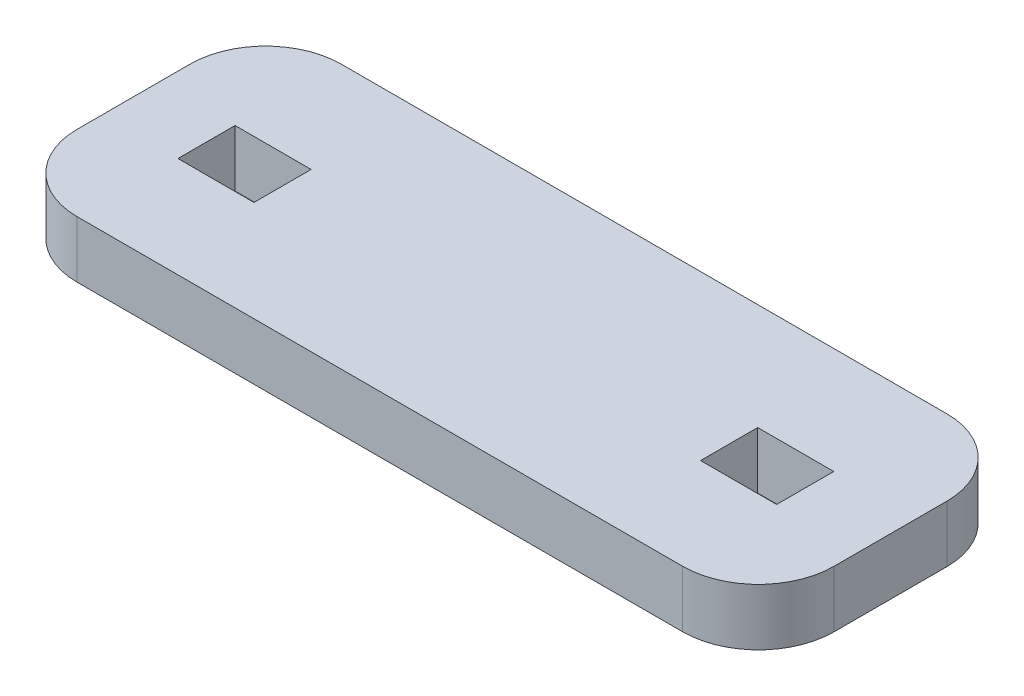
ISO-10303-21;
HEADER;
FILE_DESCRIPTION(('STEP AP214'),'2;1');
FILE_NAME('part.step','',(''),(''),'','','');
FILE_SCHEMA(('AUTOMOTIVE_DESIGN { 1 0 10303 214 1 1 1 1 }'));
ENDSEC;
DATA;
#1=APPLICATION_CONTEXT('core data for automotive mechanical design processes');
#2=APPLICATION_PROTOCOL_DEFINITION('international standard','automotive_design',2000,#1);
#3=PRODUCT_CONTEXT('',#1,'mechanical');
#4=PRODUCT('Part','Part','',(#3));
#5=PRODUCT_RELATED_PRODUCT_CATEGORY('part','',(#4));
#6=PRODUCT_DEFINITION_FORMATION('','',#4);
#7=PRODUCT_DEFINITION_CONTEXT('part definition',#1,'design');
#8=PRODUCT_DEFINITION('design','',#6,#7);
#9=PRODUCT_DEFINITION_SHAPE('','',#8);
#10=(LENGTH_UNIT() NAMED_UNIT(*) SI_UNIT(.MILLI.,.METRE.));
#11=(NAMED_UNIT(*) PLANE_ANGLE_UNIT() SI_UNIT($,.RADIAN.));
#12=(NAMED_UNIT(*) SI_UNIT($,.STERADIAN.) SOLID_ANGLE_UNIT());
#13=UNCERTAINTY_MEASURE_WITH_UNIT(LENGTH_MEASURE(1.E-05),#10,'distance_accuracy_value','');
#14=(GEOMETRIC_REPRESENTATION_CONTEXT(3) GLOBAL_UNCERTAINTY_ASSIGNED_CONTEXT((#13)) GLOBAL_UNIT_ASSIGNED_CONTEXT((#10,
#11,#12)) REPRESENTATION_CONTEXT('',''));
#15=CARTESIAN_POINT('',(0.,0.,0.));
#16=DIRECTION('',(0.,0.,1.));
#17=DIRECTION('',(1.,0.,0.));
#18=AXIS2_PLACEMENT_3D('',#15,#16,#17);
#19=CARTESIAN_POINT('',(232.831111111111,7.5,-32.7377777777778));
#20=DIRECTION('',(0.,-1.,0.));
#21=DIRECTION('',(0.,0.,-1.));
#22=AXIS2_PLACEMENT_3D('',#19,#20,#21);
#23=PLANE('',#22);
#24=DIRECTION('',(0.,0.,1.));
#25=VECTOR('',#24,1.);
#26=CARTESIAN_POINT('',(72.8311111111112,7.5,-24.6641777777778));
#27=LINE('',#26,#25);
#28=CARTESIAN_POINT('',(72.8311111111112,7.5,-24.6641777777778));
#29=VERTEX_POINT('',#28);
#30=CARTESIAN_POINT('',(72.8311111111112,7.5,-9.56417777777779));
#31=VERTEX_POINT('',#30);
#32=EDGE_CURVE('E182',#29,#31,#27,.T.);
#33=ORIENTED_EDGE('',*,*,#32,.F.);
#34=DIRECTION('',(-1.,0.,0.));
#35=VECTOR('',#34,1.);
#36=CARTESIAN_POINT('',(72.8311111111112,7.5,-24.6641777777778));
#37=LINE('',#36,#35);
#38=CARTESIAN_POINT('',(92.9311111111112,7.5,-24.6641777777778));
#39=VERTEX_POINT('',#38);
#40=EDGE_CURVE('E190',#39,#29,#37,.T.);
#41=ORIENTED_EDGE('',*,*,#40,.F.);
#42=DIRECTION('',(0.,0.,-1.));
#43=VECTOR('',#42,1.);
#44=CARTESIAN_POINT('',(92.9311111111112,7.5,-24.6641777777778));
#45=LINE('',#44,#43);
#46=CARTESIAN_POINT('',(92.9311111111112,7.5,-9.56417777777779));
#47=VERTEX_POINT('',#46);
#48=EDGE_CURVE('E187',#47,#39,#45,.T.);
#49=ORIENTED_EDGE('',*,*,#48,.F.);
#50=DIRECTION('',(1.,0.,0.));
#51=VECTOR('',#50,1.);
#52=CARTESIAN_POINT('',(72.8311111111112,7.5,-9.56417777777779));
#53=LINE('',#52,#51);
#54=EDGE_CURVE('E184',#31,#47,#53,.T.);
#55=ORIENTED_EDGE('',*,*,#54,.F.);
#56=EDGE_LOOP('',(#33,#41,#49,#55));
#57=FACE_BOUND('',#56,.T.);
#58=CARTESIAN_POINT('',(232.831111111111,7.5,-32.7377777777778));
#59=DIRECTION('',(0.,1.,0.));
#60=DIRECTION('',(0.,0.,-1.));
#61=AXIS2_PLACEMENT_3D('',#58,#59,#60);
#62=CIRCLE('',#61,20.);
#63=CARTESIAN_POINT('',(252.831111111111,7.5,-32.7377777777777));
#64=VERTEX_POINT('',#63);
#65=CARTESIAN_POINT('',(232.831111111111,7.5,-52.7377777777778));
#66=VERTEX_POINT('',#65);
#67=EDGE_CURVE('E213',#64,#66,#62,.T.);
#68=ORIENTED_EDGE('',*,*,#67,.T.);
#69=DIRECTION('',(-1.,0.,0.));
#70=VECTOR('',#69,1.);
#71=CARTESIAN_POINT('',(72.8311111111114,7.5,-52.7377777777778));
#72=LINE('',#71,#70);
#73=CARTESIAN_POINT('',(72.8311111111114,7.5,-52.7377777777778));
#74=VERTEX_POINT('',#73);
#75=EDGE_CURVE('E216',#66,#74,#72,.T.);
#76=ORIENTED_EDGE('',*,*,#75,.T.);
#77=CARTESIAN_POINT('',(72.8311111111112,7.5,-32.7377777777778));
#78=DIRECTION('',(0.,1.,0.));
#79=DIRECTION('',(0.,0.,1.));
#80=AXIS2_PLACEMENT_3D('',#77,#78,#79);
#81=CIRCLE('',#80,20.);
#82=CARTESIAN_POINT('',(52.8311111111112,7.5,-32.7377777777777));
#83=VERTEX_POINT('',#82);
#84=EDGE_CURVE('E219',#74,#83,#81,.T.);
#85=ORIENTED_EDGE('',*,*,#84,.T.);
#86=DIRECTION('',(0.,0.,1.));
#87=VECTOR('',#86,1.);
#88=CARTESIAN_POINT('',(52.8311111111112,7.5,-32.7377777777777));
#89=LINE('',#88,#87);
#90=CARTESIAN_POINT('',(52.8311111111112,7.5,-2.93777777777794));
#91=VERTEX_POINT('',#90);
#92=EDGE_CURVE('E221',#83,#91,#89,.T.);
#93=ORIENTED_EDGE('',*,*,#92,.T.);
#94=CARTESIAN_POINT('',(72.8311111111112,7.5,-2.93777777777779));
#95=DIRECTION('',(0.,1.,0.));
#96=DIRECTION('',(0.,0.,1.));
#97=AXIS2_PLACEMENT_3D('',#94,#95,#96);
#98=CIRCLE('',#97,20.);
#99=CARTESIAN_POINT('',(72.8311111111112,7.5,17.0622222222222));
#100=VERTEX_POINT('',#99);
#101=EDGE_CURVE('E223',#91,#100,#98,.T.);
#102=ORIENTED_EDGE('',*,*,#101,.T.);
#103=DIRECTION('',(1.,0.,0.));
#104=VECTOR('',#103,1.);
#105=CARTESIAN_POINT('',(72.8311111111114,7.5,17.0622222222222));
#106=LINE('',#105,#104);
#107=CARTESIAN_POINT('',(232.831111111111,7.5,17.0622222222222));
#108=VERTEX_POINT('',#107);
#109=EDGE_CURVE('E225',#100,#108,#106,.T.);
#110=ORIENTED_EDGE('',*,*,#109,.T.);
#111=CARTESIAN_POINT('',(232.831111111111,7.5,-2.93777777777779));
#112=DIRECTION('',(0.,1.,0.));
#113=DIRECTION('',(0.,0.,1.));
#114=AXIS2_PLACEMENT_3D('',#111,#112,#113);
#115=CIRCLE('',#114,20.);
#116=CARTESIAN_POINT('',(252.831111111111,7.5,-2.93777777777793));
#117=VERTEX_POINT('',#116);
#118=EDGE_CURVE('E227',#108,#117,#115,.T.);
#119=ORIENTED_EDGE('',*,*,#118,.T.);
#120=DIRECTION('',(0.,0.,-1.));
#121=VECTOR('',#120,1.);
#122=CARTESIAN_POINT('',(252.831111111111,7.5,-32.7377777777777));
#123=LINE('',#122,#121);
#124=EDGE_CURVE('E229',#117,#64,#123,.T.);
#125=ORIENTED_EDGE('',*,*,#124,.T.);
#126=EDGE_LOOP('',(#68,#76,#85,#93,#102,#110,#119,#125));
#127=FACE_BOUND('',#126,.T.);
#128=DIRECTION('',(0.,0.,1.));
#129=VECTOR('',#128,1.);
#130=CARTESIAN_POINT('',(210.996868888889,7.5,-24.5959688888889));
#131=LINE('',#130,#129);
#132=CARTESIAN_POINT('',(210.996868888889,7.5,-24.5959688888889));
#133=VERTEX_POINT('',#132);
#134=CARTESIAN_POINT('',(210.996868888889,7.5,-9.49596888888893));
#135=VERTEX_POINT('',#134);
#136=EDGE_CURVE('E146',#133,#135,#131,.T.);
#137=ORIENTED_EDGE('',*,*,#136,.F.);
#138=DIRECTION('',(-1.,0.,0.));
#139=VECTOR('',#138,1.);
#140=CARTESIAN_POINT('',(210.996868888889,7.5,-24.5959688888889));
#141=LINE('',#140,#139);
#142=CARTESIAN_POINT('',(231.096868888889,7.5,-24.5959688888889));
#143=VERTEX_POINT('',#142);
#144=EDGE_CURVE('E168',#143,#133,#141,.T.);
#145=ORIENTED_EDGE('',*,*,#144,.F.);
#146=DIRECTION('',(0.,0.,-1.));
#147=VECTOR('',#146,1.);
#148=CARTESIAN_POINT('',(231.096868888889,7.5,-24.5959688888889));
#149=LINE('',#148,#147);
#150=CARTESIAN_POINT('',(231.096868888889,7.5,-9.49596888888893));
#151=VERTEX_POINT('',#150);
#152=EDGE_CURVE('E166',#151,#143,#149,.T.);
#153=ORIENTED_EDGE('',*,*,#152,.F.);
#154=DIRECTION('',(1.,0.,0.));
#155=VECTOR('',#154,1.);
#156=CARTESIAN_POINT('',(210.996868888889,7.5,-9.49596888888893));
#157=LINE('',#156,#155);
#158=EDGE_CURVE('E154',#135,#151,#157,.T.);
#159=ORIENTED_EDGE('',*,*,#158,.F.);
#160=EDGE_LOOP('',(#137,#145,#153,#159));
#161=FACE_BOUND('',#160,.T.);
#162=ADVANCED_FACE('F33',(#57,#127,#161),#23,.F.);
#163=CARTESIAN_POINT('',(232.831111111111,-7.5,-32.7377777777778));
#164=DIRECTION('',(0.,-1.,0.));
#165=DIRECTION('',(0.,0.,-1.));
#166=AXIS2_PLACEMENT_3D('',#163,#164,#165);
#167=PLANE('',#166);
#168=CARTESIAN_POINT('',(232.831111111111,-7.5,-32.7377777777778));
#169=DIRECTION('',(0.,1.,0.));
#170=DIRECTION('',(0.,0.,-1.));
#171=AXIS2_PLACEMENT_3D('',#168,#169,#170);
#172=CIRCLE('',#171,20.);
#173=CARTESIAN_POINT('',(252.831111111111,-7.5,-32.7377777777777));
#174=VERTEX_POINT('',#173);
#175=CARTESIAN_POINT('',(232.831111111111,-7.5,-52.7377777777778));
#176=VERTEX_POINT('',#175);
#177=EDGE_CURVE('E212',#174,#176,#172,.T.);
#178=ORIENTED_EDGE('',*,*,#177,.F.);
#179=DIRECTION('',(0.,0.,-1.));
#180=VECTOR('',#179,1.);
#181=CARTESIAN_POINT('',(252.831111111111,-7.5,-32.7377777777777));
#182=LINE('',#181,#180);
#183=CARTESIAN_POINT('',(252.831111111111,-7.5,-2.93777777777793));
#184=VERTEX_POINT('',#183);
#185=EDGE_CURVE('E217',#184,#174,#182,.T.);
#186=ORIENTED_EDGE('',*,*,#185,.F.);
#187=CARTESIAN_POINT('',(232.831111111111,-7.5,-2.93777777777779));
#188=DIRECTION('',(0.,1.,0.));
#189=DIRECTION('',(0.,0.,1.));
#190=AXIS2_PLACEMENT_3D('',#187,#188,#189);
#191=CIRCLE('',#190,20.);
#192=CARTESIAN_POINT('',(232.831111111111,-7.5,17.0622222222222));
#193=VERTEX_POINT('',#192);
#194=EDGE_CURVE('E244',#193,#184,#191,.T.);
#195=ORIENTED_EDGE('',*,*,#194,.F.);
#196=DIRECTION('',(1.,0.,0.));
#197=VECTOR('',#196,1.);
#198=CARTESIAN_POINT('',(72.8311111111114,-7.5,17.0622222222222));
#199=LINE('',#198,#197);
#200=CARTESIAN_POINT('',(72.8311111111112,-7.5,17.0622222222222));
#201=VERTEX_POINT('',#200);
#202=EDGE_CURVE('E242',#201,#193,#199,.T.);
#203=ORIENTED_EDGE('',*,*,#202,.F.);
#204=CARTESIAN_POINT('',(72.8311111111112,-7.5,-2.93777777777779));
#205=DIRECTION('',(0.,1.,0.));
#206=DIRECTION('',(0.,0.,1.));
#207=AXIS2_PLACEMENT_3D('',#204,#205,#206);
#208=CIRCLE('',#207,20.);
#209=CARTESIAN_POINT('',(52.8311111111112,-7.5,-2.93777777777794));
#210=VERTEX_POINT('',#209);
#211=EDGE_CURVE('E240',#210,#201,#208,.T.);
#212=ORIENTED_EDGE('',*,*,#211,.F.);
#213=DIRECTION('',(0.,0.,1.));
#214=VECTOR('',#213,1.);
#215=CARTESIAN_POINT('',(52.8311111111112,-7.5,-32.7377777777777));
#216=LINE('',#215,#214);
#217=CARTESIAN_POINT('',(52.8311111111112,-7.5,-32.7377777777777));
#218=VERTEX_POINT('',#217);
#219=EDGE_CURVE('E238',#218,#210,#216,.T.);
#220=ORIENTED_EDGE('',*,*,#219,.F.);
#221=CARTESIAN_POINT('',(72.8311111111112,-7.5,-32.7377777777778));
#222=DIRECTION('',(0.,1.,0.));
#223=DIRECTION('',(0.,0.,1.));
#224=AXIS2_PLACEMENT_3D('',#221,#222,#223);
#225=CIRCLE('',#224,20.);
#226=CARTESIAN_POINT('',(72.8311111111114,-7.5,-52.7377777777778));
#227=VERTEX_POINT('',#226);
#228=EDGE_CURVE('E236',#227,#218,#225,.T.);
#229=ORIENTED_EDGE('',*,*,#228,.F.);
#230=DIRECTION('',(-1.,0.,0.));
#231=VECTOR('',#230,1.);
#232=CARTESIAN_POINT('',(72.8311111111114,-7.5,-52.7377777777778));
#233=LINE('',#232,#231);
#234=EDGE_CURVE('E234',#176,#227,#233,.T.);
#235=ORIENTED_EDGE('',*,*,#234,.F.);
#236=EDGE_LOOP('',(#178,#186,#195,#203,#212,#220,#229,#235));
#237=FACE_BOUND('',#236,.T.);
#238=DIRECTION('',(-1.,0.,0.));
#239=VECTOR('',#238,1.);
#240=CARTESIAN_POINT('',(72.8311111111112,-7.5,-24.6641777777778));
#241=LINE('',#240,#239);
#242=CARTESIAN_POINT('',(92.9311111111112,-7.5,-24.6641777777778));
#243=VERTEX_POINT('',#242);
#244=CARTESIAN_POINT('',(72.8311111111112,-7.5,-24.6641777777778));
#245=VERTEX_POINT('',#244);
#246=EDGE_CURVE('E185',#243,#245,#241,.T.);
#247=ORIENTED_EDGE('',*,*,#246,.T.);
#248=DIRECTION('',(0.,0.,1.));
#249=VECTOR('',#248,1.);
#250=CARTESIAN_POINT('',(72.8311111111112,-7.5,-24.6641777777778));
#251=LINE('',#250,#249);
#252=CARTESIAN_POINT('',(72.8311111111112,-7.5,-9.56417777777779));
#253=VERTEX_POINT('',#252);
#254=EDGE_CURVE('E162',#245,#253,#251,.T.);
#255=ORIENTED_EDGE('',*,*,#254,.T.);
#256=DIRECTION('',(1.,0.,0.));
#257=VECTOR('',#256,1.);
#258=CARTESIAN_POINT('',(72.8311111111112,-7.5,-9.56417777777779));
#259=LINE('',#258,#257);
#260=CARTESIAN_POINT('',(92.9311111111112,-7.5,-9.56417777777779));
#261=VERTEX_POINT('',#260);
#262=EDGE_CURVE('E195',#253,#261,#259,.T.);
#263=ORIENTED_EDGE('',*,*,#262,.T.);
#264=DIRECTION('',(0.,0.,-1.));
#265=VECTOR('',#264,1.);
#266=CARTESIAN_POINT('',(92.9311111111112,-7.5,-24.6641777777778));
#267=LINE('',#266,#265);
#268=EDGE_CURVE('E198',#261,#243,#267,.T.);
#269=ORIENTED_EDGE('',*,*,#268,.T.);
#270=EDGE_LOOP('',(#247,#255,#263,#269));
#271=FACE_BOUND('',#270,.T.);
#272=DIRECTION('',(-1.,0.,0.));
#273=VECTOR('',#272,1.);
#274=CARTESIAN_POINT('',(210.996868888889,-7.5,-24.5959688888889));
#275=LINE('',#274,#273);
#276=CARTESIAN_POINT('',(231.096868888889,-7.5,-24.5959688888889));
#277=VERTEX_POINT('',#276);
#278=CARTESIAN_POINT('',(210.996868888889,-7.5,-24.5959688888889));
#279=VERTEX_POINT('',#278);
#280=EDGE_CURVE('E155',#277,#279,#275,.T.);
#281=ORIENTED_EDGE('',*,*,#280,.T.);
#282=DIRECTION('',(0.,0.,1.));
#283=VECTOR('',#282,1.);
#284=CARTESIAN_POINT('',(210.996868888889,-7.5,-24.5959688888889));
#285=LINE('',#284,#283);
#286=CARTESIAN_POINT('',(210.996868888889,-7.5,-9.49596888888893));
#287=VERTEX_POINT('',#286);
#288=EDGE_CURVE('E56',#279,#287,#285,.T.);
#289=ORIENTED_EDGE('',*,*,#288,.T.);
#290=DIRECTION('',(1.,0.,0.));
#291=VECTOR('',#290,1.);
#292=CARTESIAN_POINT('',(210.996868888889,-7.5,-9.49596888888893));
#293=LINE('',#292,#291);
#294=CARTESIAN_POINT('',(231.096868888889,-7.5,-9.49596888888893));
#295=VERTEX_POINT('',#294);
#296=EDGE_CURVE('E161',#287,#295,#293,.T.);
#297=ORIENTED_EDGE('',*,*,#296,.T.);
#298=DIRECTION('',(0.,0.,-1.));
#299=VECTOR('',#298,1.);
#300=CARTESIAN_POINT('',(231.096868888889,-7.5,-24.5959688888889));
#301=LINE('',#300,#299);
#302=EDGE_CURVE('E174',#295,#277,#301,.T.);
#303=ORIENTED_EDGE('',*,*,#302,.T.);
#304=EDGE_LOOP('',(#281,#289,#297,#303));
#305=FACE_BOUND('',#304,.T.);
#306=ADVANCED_FACE('F274',(#237,#271,#305),#167,.T.);
#307=CARTESIAN_POINT('',(232.831111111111,7.5,-32.7377777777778));
#308=DIRECTION('',(0.,-1.,0.));
#309=DIRECTION('',(0.,0.,-1.));
#310=AXIS2_PLACEMENT_3D('',#307,#308,#309);
#311=CYLINDRICAL_SURFACE('',#310,20.);
#312=ORIENTED_EDGE('',*,*,#177,.T.);
#313=DIRECTION('',(0.,-1.,0.));
#314=VECTOR('',#313,1.);
#315=CARTESIAN_POINT('',(232.831111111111,7.5,-52.7377777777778));
#316=LINE('',#315,#314);
#317=EDGE_CURVE('E11',#66,#176,#316,.T.);
#318=ORIENTED_EDGE('',*,*,#317,.F.);
#319=ORIENTED_EDGE('',*,*,#67,.F.);
#320=DIRECTION('',(0.,-1.,0.));
#321=VECTOR('',#320,1.);
#322=CARTESIAN_POINT('',(252.831111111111,7.5,-32.7377777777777));
#323=LINE('',#322,#321);
#324=EDGE_CURVE('E231',#64,#174,#323,.T.);
#325=ORIENTED_EDGE('',*,*,#324,.T.);
#326=EDGE_LOOP('',(#312,#318,#319,#325));
#327=FACE_BOUND('',#326,.T.);
#328=ADVANCED_FACE('F35',(#327),#311,.T.);
#329=CARTESIAN_POINT('',(72.8311111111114,7.5,-52.7377777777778));
#330=DIRECTION('',(0.,0.,1.));
#331=DIRECTION('',(1.,0.,0.));
#332=AXIS2_PLACEMENT_3D('',#329,#330,#331);
#333=PLANE('',#332);
#334=ORIENTED_EDGE('',*,*,#234,.T.);
#335=DIRECTION('',(0.,-1.,0.));
#336=VECTOR('',#335,1.);
#337=CARTESIAN_POINT('',(72.8311111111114,7.5,-52.7377777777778));
#338=LINE('',#337,#336);
#339=EDGE_CURVE('E41',#74,#227,#338,.T.);
#340=ORIENTED_EDGE('',*,*,#339,.F.);
#341=ORIENTED_EDGE('',*,*,#75,.F.);
#342=ORIENTED_EDGE('',*,*,#317,.T.);
#343=EDGE_LOOP('',(#334,#340,#341,#342));
#344=FACE_BOUND('',#343,.T.);
#345=ADVANCED_FACE('F291',(#344),#333,.F.);
#346=CARTESIAN_POINT('',(72.8311111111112,7.5,-32.7377777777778));
#347=DIRECTION('',(0.,-1.,0.));
#348=DIRECTION('',(0.,0.,-1.));
#349=AXIS2_PLACEMENT_3D('',#346,#347,#348);
#350=CYLINDRICAL_SURFACE('',#349,20.);
#351=ORIENTED_EDGE('',*,*,#228,.T.);
#352=DIRECTION('',(0.,-1.,0.));
#353=VECTOR('',#352,1.);
#354=CARTESIAN_POINT('',(52.8311111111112,7.5,-32.7377777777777));
#355=LINE('',#354,#353);
#356=EDGE_CURVE('E261',#83,#218,#355,.T.);
#357=ORIENTED_EDGE('',*,*,#356,.F.);
#358=ORIENTED_EDGE('',*,*,#84,.F.);
#359=ORIENTED_EDGE('',*,*,#339,.T.);
#360=EDGE_LOOP('',(#351,#357,#358,#359));
#361=FACE_BOUND('',#360,.T.);
#362=ADVANCED_FACE('F268',(#361),#350,.T.);
#363=CARTESIAN_POINT('',(52.8311111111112,7.5,-32.7377777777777));
#364=DIRECTION('',(1.,0.,0.));
#365=DIRECTION('',(0.,0.,-1.));
#366=AXIS2_PLACEMENT_3D('',#363,#364,#365);
#367=PLANE('',#366);
#368=ORIENTED_EDGE('',*,*,#219,.T.);
#369=DIRECTION('',(0.,-1.,0.));
#370=VECTOR('',#369,1.);
#371=CARTESIAN_POINT('',(52.8311111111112,7.5,-2.93777777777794));
#372=LINE('',#371,#370);
#373=EDGE_CURVE('E258',#91,#210,#372,.T.);
#374=ORIENTED_EDGE('',*,*,#373,.F.);
#375=ORIENTED_EDGE('',*,*,#92,.F.);
#376=ORIENTED_EDGE('',*,*,#356,.T.);
#377=EDGE_LOOP('',(#368,#374,#375,#376));
#378=FACE_BOUND('',#377,.T.);
#379=ADVANCED_FACE('F280',(#378),#367,.F.);
#380=CARTESIAN_POINT('',(72.8311111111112,7.5,-2.93777777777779));
#381=DIRECTION('',(0.,-1.,0.));
#382=DIRECTION('',(0.,0.,-1.));
#383=AXIS2_PLACEMENT_3D('',#380,#381,#382);
#384=CYLINDRICAL_SURFACE('',#383,20.);
#385=ORIENTED_EDGE('',*,*,#211,.T.);
#386=DIRECTION('',(0.,-1.,0.));
#387=VECTOR('',#386,1.);
#388=CARTESIAN_POINT('',(72.8311111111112,7.5,17.0622222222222));
#389=LINE('',#388,#387);
#390=EDGE_CURVE('E255',#100,#201,#389,.T.);
#391=ORIENTED_EDGE('',*,*,#390,.F.);
#392=ORIENTED_EDGE('',*,*,#101,.F.);
#393=ORIENTED_EDGE('',*,*,#373,.T.);
#394=EDGE_LOOP('',(#385,#391,#392,#393));
#395=FACE_BOUND('',#394,.T.);
#396=ADVANCED_FACE('F284',(#395),#384,.T.);
#397=CARTESIAN_POINT('',(72.8311111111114,7.5,17.0622222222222));
#398=DIRECTION('',(0.,0.,-1.));
#399=DIRECTION('',(-1.,0.,0.));
#400=AXIS2_PLACEMENT_3D('',#397,#398,#399);
#401=PLANE('',#400);
#402=ORIENTED_EDGE('',*,*,#202,.T.);
#403=DIRECTION('',(0.,-1.,0.));
#404=VECTOR('',#403,1.);
#405=CARTESIAN_POINT('',(232.831111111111,7.5,17.0622222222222));
#406=LINE('',#405,#404);
#407=EDGE_CURVE('E252',#108,#193,#406,.T.);
#408=ORIENTED_EDGE('',*,*,#407,.F.);
#409=ORIENTED_EDGE('',*,*,#109,.F.);
#410=ORIENTED_EDGE('',*,*,#390,.T.);
#411=EDGE_LOOP('',(#402,#408,#409,#410));
#412=FACE_BOUND('',#411,.T.);
#413=ADVANCED_FACE('F304',(#412),#401,.F.);
#414=CARTESIAN_POINT('',(232.831111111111,7.5,-2.93777777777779));
#415=DIRECTION('',(0.,-1.,0.));
#416=DIRECTION('',(0.,0.,-1.));
#417=AXIS2_PLACEMENT_3D('',#414,#415,#416);
#418=CYLINDRICAL_SURFACE('',#417,20.);
#419=ORIENTED_EDGE('',*,*,#194,.T.);
#420=DIRECTION('',(0.,-1.,0.));
#421=VECTOR('',#420,1.);
#422=CARTESIAN_POINT('',(252.831111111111,7.5,-2.93777777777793));
#423=LINE('',#422,#421);
#424=EDGE_CURVE('E249',#117,#184,#423,.T.);
#425=ORIENTED_EDGE('',*,*,#424,.F.);
#426=ORIENTED_EDGE('',*,*,#118,.F.);
#427=ORIENTED_EDGE('',*,*,#407,.T.);
#428=EDGE_LOOP('',(#419,#425,#426,#427));
#429=FACE_BOUND('',#428,.T.);
#430=ADVANCED_FACE('F302',(#429),#418,.T.);
#431=CARTESIAN_POINT('',(252.831111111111,7.5,-32.7377777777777));
#432=DIRECTION('',(-1.,0.,0.));
#433=DIRECTION('',(0.,0.,1.));
#434=AXIS2_PLACEMENT_3D('',#431,#432,#433);
#435=PLANE('',#434);
#436=ORIENTED_EDGE('',*,*,#185,.T.);
#437=ORIENTED_EDGE('',*,*,#324,.F.);
#438=ORIENTED_EDGE('',*,*,#124,.F.);
#439=ORIENTED_EDGE('',*,*,#424,.T.);
#440=EDGE_LOOP('',(#436,#437,#438,#439));
#441=FACE_BOUND('',#440,.T.);
#442=ADVANCED_FACE('F297',(#441),#435,.F.);
#443=CARTESIAN_POINT('',(72.8311111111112,7.5,-24.6641777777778));
#444=DIRECTION('',(1.,0.,0.));
#445=DIRECTION('',(0.,0.,-1.));
#446=AXIS2_PLACEMENT_3D('',#443,#444,#445);
#447=PLANE('',#446);
#448=ORIENTED_EDGE('',*,*,#254,.F.);
#449=DIRECTION('',(0.,-1.,0.));
#450=VECTOR('',#449,1.);
#451=CARTESIAN_POINT('',(72.8311111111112,7.5,-24.6641777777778));
#452=LINE('',#451,#450);
#453=EDGE_CURVE('E192',#29,#245,#452,.T.);
#454=ORIENTED_EDGE('',*,*,#453,.F.);
#455=ORIENTED_EDGE('',*,*,#32,.T.);
#456=DIRECTION('',(0.,-1.,0.));
#457=VECTOR('',#456,1.);
#458=CARTESIAN_POINT('',(72.8311111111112,7.5,-9.56417777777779));
#459=LINE('',#458,#457);
#460=EDGE_CURVE('E209',#31,#253,#459,.T.);
#461=ORIENTED_EDGE('',*,*,#460,.T.);
#462=EDGE_LOOP('',(#448,#454,#455,#461));
#463=FACE_BOUND('',#462,.T.);
#464=ADVANCED_FACE('F322',(#463),#447,.T.);
#465=CARTESIAN_POINT('',(72.8311111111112,7.5,-9.56417777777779));
#466=DIRECTION('',(0.,0.,-1.));
#467=DIRECTION('',(-1.,0.,0.));
#468=AXIS2_PLACEMENT_3D('',#465,#466,#467);
#469=PLANE('',#468);
#470=ORIENTED_EDGE('',*,*,#262,.F.);
#471=ORIENTED_EDGE('',*,*,#460,.F.);
#472=ORIENTED_EDGE('',*,*,#54,.T.);
#473=DIRECTION('',(0.,-1.,0.));
#474=VECTOR('',#473,1.);
#475=CARTESIAN_POINT('',(92.9311111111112,7.5,-9.56417777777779));
#476=LINE('',#475,#474);
#477=EDGE_CURVE('E207',#47,#261,#476,.T.);
#478=ORIENTED_EDGE('',*,*,#477,.T.);
#479=EDGE_LOOP('',(#470,#471,#472,#478));
#480=FACE_BOUND('',#479,.T.);
#481=ADVANCED_FACE('F329',(#480),#469,.T.);
#482=CARTESIAN_POINT('',(92.9311111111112,7.5,-24.6641777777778));
#483=DIRECTION('',(-1.,0.,0.));
#484=DIRECTION('',(0.,0.,1.));
#485=AXIS2_PLACEMENT_3D('',#482,#483,#484);
#486=PLANE('',#485);
#487=ORIENTED_EDGE('',*,*,#268,.F.);
#488=ORIENTED_EDGE('',*,*,#477,.F.);
#489=ORIENTED_EDGE('',*,*,#48,.T.);
#490=DIRECTION('',(0.,-1.,0.));
#491=VECTOR('',#490,1.);
#492=CARTESIAN_POINT('',(92.9311111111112,7.5,-24.6641777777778));
#493=LINE('',#492,#491);
#494=EDGE_CURVE('E205',#39,#243,#493,.T.);
#495=ORIENTED_EDGE('',*,*,#494,.T.);
#496=EDGE_LOOP('',(#487,#488,#489,#495));
#497=FACE_BOUND('',#496,.T.);
#498=ADVANCED_FACE('F334',(#497),#486,.T.);
#499=CARTESIAN_POINT('',(72.8311111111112,7.5,-24.6641777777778));
#500=DIRECTION('',(0.,0.,1.));
#501=DIRECTION('',(1.,0.,0.));
#502=AXIS2_PLACEMENT_3D('',#499,#500,#501);
#503=PLANE('',#502);
#504=ORIENTED_EDGE('',*,*,#246,.F.);
#505=ORIENTED_EDGE('',*,*,#494,.F.);
#506=ORIENTED_EDGE('',*,*,#40,.T.);
#507=ORIENTED_EDGE('',*,*,#453,.T.);
#508=EDGE_LOOP('',(#504,#505,#506,#507));
#509=FACE_BOUND('',#508,.T.);
#510=ADVANCED_FACE('F340',(#509),#503,.T.);
#511=CARTESIAN_POINT('',(210.996868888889,7.5,-24.5959688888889));
#512=DIRECTION('',(1.,0.,0.));
#513=DIRECTION('',(0.,0.,-1.));
#514=AXIS2_PLACEMENT_3D('',#511,#512,#513);
#515=PLANE('',#514);
#516=ORIENTED_EDGE('',*,*,#288,.F.);
#517=DIRECTION('',(0.,-1.,0.));
#518=VECTOR('',#517,1.);
#519=CARTESIAN_POINT('',(210.996868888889,7.5,-24.5959688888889));
#520=LINE('',#519,#518);
#521=EDGE_CURVE('E150',#133,#279,#520,.T.);
#522=ORIENTED_EDGE('',*,*,#521,.F.);
#523=ORIENTED_EDGE('',*,*,#136,.T.);
#524=DIRECTION('',(0.,-1.,0.));
#525=VECTOR('',#524,1.);
#526=CARTESIAN_POINT('',(210.996868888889,7.5,-9.49596888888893));
#527=LINE('',#526,#525);
#528=EDGE_CURVE('E149',#135,#287,#527,.T.);
#529=ORIENTED_EDGE('',*,*,#528,.T.);
#530=EDGE_LOOP('',(#516,#522,#523,#529));
#531=FACE_BOUND('',#530,.T.);
#532=ADVANCED_FACE('F148',(#531),#515,.T.);
#533=CARTESIAN_POINT('',(210.996868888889,7.5,-9.49596888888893));
#534=DIRECTION('',(0.,0.,-1.));
#535=DIRECTION('',(-1.,0.,0.));
#536=AXIS2_PLACEMENT_3D('',#533,#534,#535);
#537=PLANE('',#536);
#538=ORIENTED_EDGE('',*,*,#296,.F.);
#539=ORIENTED_EDGE('',*,*,#528,.F.);
#540=ORIENTED_EDGE('',*,*,#158,.T.);
#541=DIRECTION('',(0.,-1.,0.));
#542=VECTOR('',#541,1.);
#543=CARTESIAN_POINT('',(231.096868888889,7.5,-9.49596888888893));
#544=LINE('',#543,#542);
#545=EDGE_CURVE('E163',#151,#295,#544,.T.);
#546=ORIENTED_EDGE('',*,*,#545,.T.);
#547=EDGE_LOOP('',(#538,#539,#540,#546));
#548=FACE_BOUND('',#547,.T.);
#549=ADVANCED_FACE('F158',(#548),#537,.T.);
#550=CARTESIAN_POINT('',(231.096868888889,7.5,-24.5959688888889));
#551=DIRECTION('',(-1.,0.,0.));
#552=DIRECTION('',(0.,0.,1.));
#553=AXIS2_PLACEMENT_3D('',#550,#551,#552);
#554=PLANE('',#553);
#555=ORIENTED_EDGE('',*,*,#302,.F.);
#556=ORIENTED_EDGE('',*,*,#545,.F.);
#557=ORIENTED_EDGE('',*,*,#152,.T.);
#558=DIRECTION('',(0.,-1.,0.));
#559=VECTOR('',#558,1.);
#560=CARTESIAN_POINT('',(231.096868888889,7.5,-24.5959688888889));
#561=LINE('',#560,#559);
#562=EDGE_CURVE('E48',#143,#277,#561,.T.);
#563=ORIENTED_EDGE('',*,*,#562,.T.);
#564=EDGE_LOOP('',(#555,#556,#557,#563));
#565=FACE_BOUND('',#564,.T.);
#566=ADVANCED_FACE('F359',(#565),#554,.T.);
#567=CARTESIAN_POINT('',(210.996868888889,7.5,-24.5959688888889));
#568=DIRECTION('',(0.,0.,1.));
#569=DIRECTION('',(1.,0.,0.));
#570=AXIS2_PLACEMENT_3D('',#567,#568,#569);
#571=PLANE('',#570);
#572=ORIENTED_EDGE('',*,*,#280,.F.);
#573=ORIENTED_EDGE('',*,*,#562,.F.);
#574=ORIENTED_EDGE('',*,*,#144,.T.);
#575=ORIENTED_EDGE('',*,*,#521,.T.);
#576=EDGE_LOOP('',(#572,#573,#574,#575));
#577=FACE_BOUND('',#576,.T.);
#578=ADVANCED_FACE('F362',(#577),#571,.T.);
#579=CLOSED_SHELL('',(#162,#306,#328,#345,#362,#379,#396,#413,#430,#442,#464,#481,#498,#510,
#532,#549,#566,#578));
#580=MANIFOLD_SOLID_BREP('B2',#579);
#581=ADVANCED_BREP_SHAPE_REPRESENTATION('',(#18,#580),#14);
#582=SHAPE_DEFINITION_REPRESENTATION(#9,#581);
ENDSEC;
END-ISO-10303-21;
